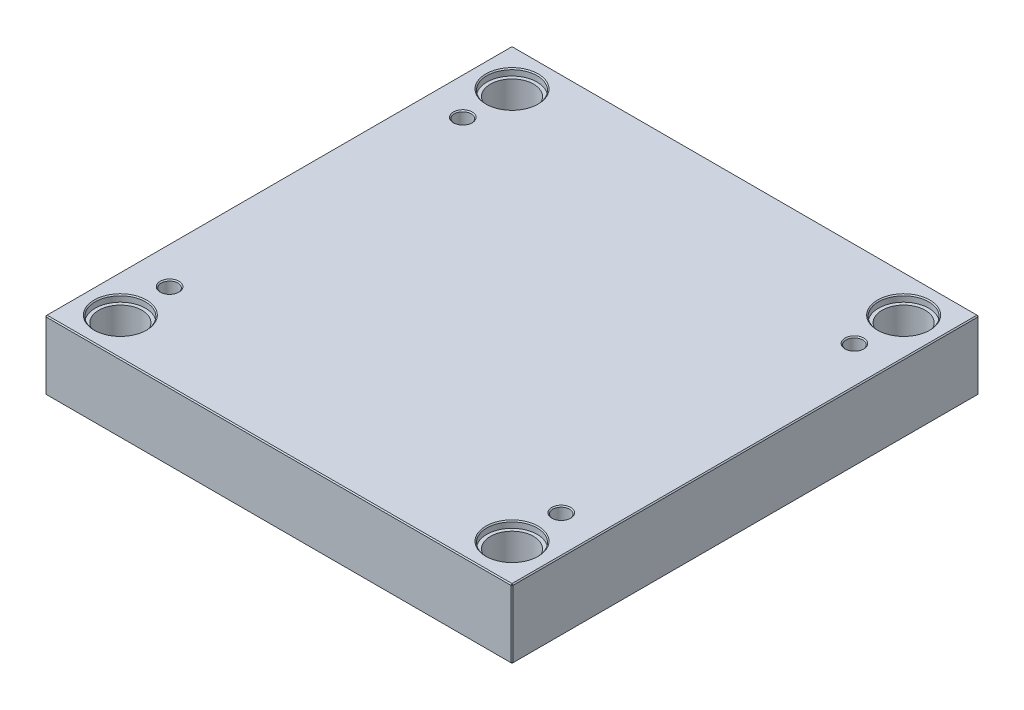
ISO-10303-21;
HEADER;
FILE_DESCRIPTION(('STEP AP214'),'2;1');
FILE_NAME('part.step','',(''),(''),'','','');
FILE_SCHEMA(('AUTOMOTIVE_DESIGN { 1 0 10303 214 1 1 1 1 }'));
ENDSEC;
DATA;
#1=APPLICATION_CONTEXT('core data for automotive mechanical design processes');
#2=APPLICATION_PROTOCOL_DEFINITION('international standard','automotive_design',2000,#1);
#3=PRODUCT_CONTEXT('',#1,'mechanical');
#4=PRODUCT('Part','Part','',(#3));
#5=PRODUCT_RELATED_PRODUCT_CATEGORY('part','',(#4));
#6=PRODUCT_DEFINITION_FORMATION('','',#4);
#7=PRODUCT_DEFINITION_CONTEXT('part definition',#1,'design');
#8=PRODUCT_DEFINITION('design','',#6,#7);
#9=PRODUCT_DEFINITION_SHAPE('','',#8);
#10=(LENGTH_UNIT() NAMED_UNIT(*) SI_UNIT(.MILLI.,.METRE.));
#11=(NAMED_UNIT(*) PLANE_ANGLE_UNIT() SI_UNIT($,.RADIAN.));
#12=(NAMED_UNIT(*) SI_UNIT($,.STERADIAN.) SOLID_ANGLE_UNIT());
#13=UNCERTAINTY_MEASURE_WITH_UNIT(LENGTH_MEASURE(1.E-05),#10,'distance_accuracy_value','');
#14=(GEOMETRIC_REPRESENTATION_CONTEXT(3) GLOBAL_UNCERTAINTY_ASSIGNED_CONTEXT((#13)) GLOBAL_UNIT_ASSIGNED_CONTEXT((#10,
#11,#12)) REPRESENTATION_CONTEXT('',''));
#15=CARTESIAN_POINT('',(0.,0.,0.));
#16=DIRECTION('',(0.,0.,1.));
#17=DIRECTION('',(1.,0.,0.));
#18=AXIS2_PLACEMENT_3D('',#15,#16,#17);
#19=CARTESIAN_POINT('',(-187.,0.,-187.));
#20=DIRECTION('',(0.,1.,0.));
#21=DIRECTION('',(0.,0.,1.));
#22=AXIS2_PLACEMENT_3D('',#19,#20,#21);
#23=CYLINDRICAL_SURFACE('',#22,20.65);
#24=CARTESIAN_POINT('',(-187.,0.999999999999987,-187.));
#25=DIRECTION('',(0.,1.,0.));
#26=DIRECTION('',(0.,0.,1.));
#27=AXIS2_PLACEMENT_3D('',#24,#25,#26);
#28=CIRCLE('',#27,20.65);
#29=CARTESIAN_POINT('',(-187.,0.999999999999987,-166.35));
#30=VERTEX_POINT('',#29);
#31=EDGE_CURVE('E472',#30,#30,#28,.F.);
#32=ORIENTED_EDGE('',*,*,#31,.T.);
#33=EDGE_LOOP('',(#32));
#34=FACE_BOUND('',#33,.T.);
#35=CARTESIAN_POINT('',(-187.,59.7,-187.));
#36=DIRECTION('',(0.,1.,0.));
#37=DIRECTION('',(0.,0.,1.));
#38=AXIS2_PLACEMENT_3D('',#35,#36,#37);
#39=CIRCLE('',#38,20.65);
#40=CARTESIAN_POINT('',(-187.,59.7,-166.35));
#41=VERTEX_POINT('',#40);
#42=EDGE_CURVE('E221',#41,#41,#39,.F.);
#43=ORIENTED_EDGE('',*,*,#42,.F.);
#44=EDGE_LOOP('',(#43));
#45=FACE_BOUND('',#44,.T.);
#46=ADVANCED_FACE('F16',(#34,#45),#23,.F.);
#47=CARTESIAN_POINT('',(187.,0.,-187.));
#48=DIRECTION('',(0.,1.,0.));
#49=DIRECTION('',(0.,0.,1.));
#50=AXIS2_PLACEMENT_3D('',#47,#48,#49);
#51=CYLINDRICAL_SURFACE('',#50,20.65);
#52=CARTESIAN_POINT('',(187.,0.999999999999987,-187.));
#53=DIRECTION('',(0.,1.,0.));
#54=DIRECTION('',(0.,0.,1.));
#55=AXIS2_PLACEMENT_3D('',#52,#53,#54);
#56=CIRCLE('',#55,20.65);
#57=CARTESIAN_POINT('',(187.,0.999999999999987,-166.35));
#58=VERTEX_POINT('',#57);
#59=EDGE_CURVE('E474',#58,#58,#56,.F.);
#60=ORIENTED_EDGE('',*,*,#59,.T.);
#61=EDGE_LOOP('',(#60));
#62=FACE_BOUND('',#61,.T.);
#63=CARTESIAN_POINT('',(187.,59.7,-187.));
#64=DIRECTION('',(0.,1.,0.));
#65=DIRECTION('',(0.,0.,1.));
#66=AXIS2_PLACEMENT_3D('',#63,#64,#65);
#67=CIRCLE('',#66,20.65);
#68=CARTESIAN_POINT('',(187.,59.7,-166.35));
#69=VERTEX_POINT('',#68);
#70=EDGE_CURVE('E218',#69,#69,#67,.F.);
#71=ORIENTED_EDGE('',*,*,#70,.F.);
#72=EDGE_LOOP('',(#71));
#73=FACE_BOUND('',#72,.T.);
#74=ADVANCED_FACE('F263',(#62,#73),#51,.F.);
#75=CARTESIAN_POINT('',(187.,0.,187.));
#76=DIRECTION('',(0.,1.,0.));
#77=DIRECTION('',(0.,0.,1.));
#78=AXIS2_PLACEMENT_3D('',#75,#76,#77);
#79=CYLINDRICAL_SURFACE('',#78,20.65);
#80=CARTESIAN_POINT('',(187.,0.99999999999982,187.));
#81=DIRECTION('',(0.,1.,0.));
#82=DIRECTION('',(0.,0.,1.));
#83=AXIS2_PLACEMENT_3D('',#80,#81,#82);
#84=CIRCLE('',#83,20.65);
#85=CARTESIAN_POINT('',(187.,0.99999999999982,207.65));
#86=VERTEX_POINT('',#85);
#87=EDGE_CURVE('E477',#86,#86,#84,.F.);
#88=ORIENTED_EDGE('',*,*,#87,.T.);
#89=EDGE_LOOP('',(#88));
#90=FACE_BOUND('',#89,.T.);
#91=CARTESIAN_POINT('',(187.,59.7,187.));
#92=DIRECTION('',(0.,1.,0.));
#93=DIRECTION('',(0.,0.,1.));
#94=AXIS2_PLACEMENT_3D('',#91,#92,#93);
#95=CIRCLE('',#94,20.65);
#96=CARTESIAN_POINT('',(187.,59.7,207.65));
#97=VERTEX_POINT('',#96);
#98=EDGE_CURVE('E214',#97,#97,#95,.F.);
#99=ORIENTED_EDGE('',*,*,#98,.F.);
#100=EDGE_LOOP('',(#99));
#101=FACE_BOUND('',#100,.T.);
#102=ADVANCED_FACE('F270',(#90,#101),#79,.F.);
#103=CARTESIAN_POINT('',(-187.,0.,187.));
#104=DIRECTION('',(0.,1.,0.));
#105=DIRECTION('',(0.,0.,1.));
#106=AXIS2_PLACEMENT_3D('',#103,#104,#105);
#107=CYLINDRICAL_SURFACE('',#106,20.65);
#108=CARTESIAN_POINT('',(-187.,0.99999999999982,187.));
#109=DIRECTION('',(0.,1.,0.));
#110=DIRECTION('',(0.,0.,1.));
#111=AXIS2_PLACEMENT_3D('',#108,#109,#110);
#112=CIRCLE('',#111,20.65);
#113=CARTESIAN_POINT('',(-187.,0.99999999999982,207.65));
#114=VERTEX_POINT('',#113);
#115=EDGE_CURVE('E480',#114,#114,#112,.F.);
#116=ORIENTED_EDGE('',*,*,#115,.T.);
#117=EDGE_LOOP('',(#116));
#118=FACE_BOUND('',#117,.T.);
#119=CARTESIAN_POINT('',(-187.,59.7,187.));
#120=DIRECTION('',(0.,1.,0.));
#121=DIRECTION('',(0.,0.,1.));
#122=AXIS2_PLACEMENT_3D('',#119,#120,#121);
#123=CIRCLE('',#122,20.65);
#124=CARTESIAN_POINT('',(-187.,59.7,207.65));
#125=VERTEX_POINT('',#124);
#126=EDGE_CURVE('E211',#125,#125,#123,.F.);
#127=ORIENTED_EDGE('',*,*,#126,.F.);
#128=EDGE_LOOP('',(#127));
#129=FACE_BOUND('',#128,.T.);
#130=ADVANCED_FACE('F277',(#118,#129),#107,.F.);
#131=CARTESIAN_POINT('',(-223.,66.,223.));
#132=DIRECTION('',(1.,0.,0.));
#133=DIRECTION('',(0.,0.,-1.));
#134=AXIS2_PLACEMENT_3D('',#131,#132,#133);
#135=PLANE('',#134);
#136=DIRECTION('',(0.,-1.,0.));
#137=VECTOR('',#136,1.);
#138=CARTESIAN_POINT('',(-223.,66.,-222.));
#139=LINE('',#138,#137);
#140=CARTESIAN_POINT('',(-223.,65.,-222.));
#141=VERTEX_POINT('',#140);
#142=CARTESIAN_POINT('',(-223.,1.,-222.));
#143=VERTEX_POINT('',#142);
#144=EDGE_CURVE('E487',#141,#143,#139,.T.);
#145=ORIENTED_EDGE('',*,*,#144,.T.);
#146=DIRECTION('',(0.,0.,1.));
#147=VECTOR('',#146,1.);
#148=CARTESIAN_POINT('',(-223.,1.,223.));
#149=LINE('',#148,#147);
#150=CARTESIAN_POINT('',(-223.,1.,222.));
#151=VERTEX_POINT('',#150);
#152=EDGE_CURVE('E490',#143,#151,#149,.T.);
#153=ORIENTED_EDGE('',*,*,#152,.T.);
#154=DIRECTION('',(0.,1.,0.));
#155=VECTOR('',#154,1.);
#156=CARTESIAN_POINT('',(-223.,66.,222.));
#157=LINE('',#156,#155);
#158=CARTESIAN_POINT('',(-223.,65.,222.));
#159=VERTEX_POINT('',#158);
#160=EDGE_CURVE('E485',#151,#159,#157,.T.);
#161=ORIENTED_EDGE('',*,*,#160,.T.);
#162=DIRECTION('',(0.,0.,-1.));
#163=VECTOR('',#162,1.);
#164=CARTESIAN_POINT('',(-223.,65.,-223.));
#165=LINE('',#164,#163);
#166=EDGE_CURVE('E483',#159,#141,#165,.T.);
#167=ORIENTED_EDGE('',*,*,#166,.T.);
#168=EDGE_LOOP('',(#145,#153,#161,#167));
#169=FACE_BOUND('',#168,.T.);
#170=ADVANCED_FACE('F298',(#169),#135,.F.);
#171=CARTESIAN_POINT('',(223.,66.,223.));
#172=DIRECTION('',(0.,0.,-1.));
#173=DIRECTION('',(-1.,0.,0.));
#174=AXIS2_PLACEMENT_3D('',#171,#172,#173);
#175=PLANE('',#174);
#176=DIRECTION('',(-1.,0.,0.));
#177=VECTOR('',#176,1.);
#178=CARTESIAN_POINT('',(-223.,65.,223.));
#179=LINE('',#178,#177);
#180=CARTESIAN_POINT('',(222.,65.,223.));
#181=VERTEX_POINT('',#180);
#182=CARTESIAN_POINT('',(-222.,65.,223.));
#183=VERTEX_POINT('',#182);
#184=EDGE_CURVE('E509',#181,#183,#179,.T.);
#185=ORIENTED_EDGE('',*,*,#184,.T.);
#186=DIRECTION('',(0.,-1.,0.));
#187=VECTOR('',#186,1.);
#188=CARTESIAN_POINT('',(-222.,66.,223.));
#189=LINE('',#188,#187);
#190=CARTESIAN_POINT('',(-222.,1.,223.));
#191=VERTEX_POINT('',#190);
#192=EDGE_CURVE('E515',#183,#191,#189,.T.);
#193=ORIENTED_EDGE('',*,*,#192,.T.);
#194=DIRECTION('',(1.,0.,0.));
#195=VECTOR('',#194,1.);
#196=CARTESIAN_POINT('',(223.,1.,223.));
#197=LINE('',#196,#195);
#198=CARTESIAN_POINT('',(222.,1.,223.));
#199=VERTEX_POINT('',#198);
#200=EDGE_CURVE('E513',#191,#199,#197,.T.);
#201=ORIENTED_EDGE('',*,*,#200,.T.);
#202=DIRECTION('',(0.,1.,0.));
#203=VECTOR('',#202,1.);
#204=CARTESIAN_POINT('',(222.,66.,223.));
#205=LINE('',#204,#203);
#206=EDGE_CURVE('E511',#199,#181,#205,.T.);
#207=ORIENTED_EDGE('',*,*,#206,.T.);
#208=EDGE_LOOP('',(#185,#193,#201,#207));
#209=FACE_BOUND('',#208,.T.);
#210=ADVANCED_FACE('F294',(#209),#175,.F.);
#211=CARTESIAN_POINT('',(223.,66.,223.));
#212=DIRECTION('',(-1.,0.,0.));
#213=DIRECTION('',(0.,0.,1.));
#214=AXIS2_PLACEMENT_3D('',#211,#212,#213);
#215=PLANE('',#214);
#216=DIRECTION('',(0.,0.,-1.));
#217=VECTOR('',#216,1.);
#218=CARTESIAN_POINT('',(223.,1.,223.));
#219=LINE('',#218,#217);
#220=CARTESIAN_POINT('',(223.,1.,222.));
#221=VERTEX_POINT('',#220);
#222=CARTESIAN_POINT('',(223.,1.,-222.));
#223=VERTEX_POINT('',#222);
#224=EDGE_CURVE('E504',#221,#223,#219,.T.);
#225=ORIENTED_EDGE('',*,*,#224,.T.);
#226=DIRECTION('',(0.,1.,0.));
#227=VECTOR('',#226,1.);
#228=CARTESIAN_POINT('',(223.,66.,-222.));
#229=LINE('',#228,#227);
#230=CARTESIAN_POINT('',(223.,65.,-222.));
#231=VERTEX_POINT('',#230);
#232=EDGE_CURVE('E506',#223,#231,#229,.T.);
#233=ORIENTED_EDGE('',*,*,#232,.T.);
#234=DIRECTION('',(0.,0.,1.));
#235=VECTOR('',#234,1.);
#236=CARTESIAN_POINT('',(223.,65.,223.));
#237=LINE('',#236,#235);
#238=CARTESIAN_POINT('',(223.,65.,222.));
#239=VERTEX_POINT('',#238);
#240=EDGE_CURVE('E500',#231,#239,#237,.T.);
#241=ORIENTED_EDGE('',*,*,#240,.T.);
#242=DIRECTION('',(0.,-1.,0.));
#243=VECTOR('',#242,1.);
#244=CARTESIAN_POINT('',(223.,66.,222.));
#245=LINE('',#244,#243);
#246=EDGE_CURVE('E502',#239,#221,#245,.T.);
#247=ORIENTED_EDGE('',*,*,#246,.T.);
#248=EDGE_LOOP('',(#225,#233,#241,#247));
#249=FACE_BOUND('',#248,.T.);
#250=ADVANCED_FACE('F290',(#249),#215,.F.);
#251=CARTESIAN_POINT('',(223.,66.,-223.));
#252=DIRECTION('',(0.,0.,1.));
#253=DIRECTION('',(1.,0.,0.));
#254=AXIS2_PLACEMENT_3D('',#251,#252,#253);
#255=PLANE('',#254);
#256=DIRECTION('',(0.,-1.,0.));
#257=VECTOR('',#256,1.);
#258=CARTESIAN_POINT('',(222.,66.,-223.));
#259=LINE('',#258,#257);
#260=CARTESIAN_POINT('',(222.,65.,-223.));
#261=VERTEX_POINT('',#260);
#262=CARTESIAN_POINT('',(222.,1.,-223.));
#263=VERTEX_POINT('',#262);
#264=EDGE_CURVE('E494',#261,#263,#259,.T.);
#265=ORIENTED_EDGE('',*,*,#264,.T.);
#266=DIRECTION('',(-1.,0.,0.));
#267=VECTOR('',#266,1.);
#268=CARTESIAN_POINT('',(223.,1.,-223.));
#269=LINE('',#268,#267);
#270=CARTESIAN_POINT('',(-222.,1.,-223.));
#271=VERTEX_POINT('',#270);
#272=EDGE_CURVE('E138',#263,#271,#269,.T.);
#273=ORIENTED_EDGE('',*,*,#272,.T.);
#274=DIRECTION('',(0.,1.,0.));
#275=VECTOR('',#274,1.);
#276=CARTESIAN_POINT('',(-222.,66.,-223.));
#277=LINE('',#276,#275);
#278=CARTESIAN_POINT('',(-222.,65.,-223.));
#279=VERTEX_POINT('',#278);
#280=EDGE_CURVE('E496',#271,#279,#277,.T.);
#281=ORIENTED_EDGE('',*,*,#280,.T.);
#282=DIRECTION('',(1.,0.,0.));
#283=VECTOR('',#282,1.);
#284=CARTESIAN_POINT('',(223.,65.,-223.));
#285=LINE('',#284,#283);
#286=EDGE_CURVE('E492',#279,#261,#285,.T.);
#287=ORIENTED_EDGE('',*,*,#286,.T.);
#288=EDGE_LOOP('',(#265,#273,#281,#287));
#289=FACE_BOUND('',#288,.T.);
#290=ADVANCED_FACE('F282',(#289),#255,.F.);
#291=CARTESIAN_POINT('',(0.,66.,0.));
#292=DIRECTION('',(0.,1.,0.));
#293=DIRECTION('',(0.,0.,1.));
#294=AXIS2_PLACEMENT_3D('',#291,#292,#293);
#295=PLANE('',#294);
#296=CARTESIAN_POINT('',(187.,66.,187.));
#297=DIRECTION('',(0.,1.,0.));
#298=DIRECTION('',(0.,0.,1.));
#299=AXIS2_PLACEMENT_3D('',#296,#297,#298);
#300=CIRCLE('',#299,25.);
#301=CARTESIAN_POINT('',(187.,66.,212.));
#302=VERTEX_POINT('',#301);
#303=EDGE_CURVE('E236',#302,#302,#300,.F.);
#304=ORIENTED_EDGE('',*,*,#303,.T.);
#305=EDGE_LOOP('',(#304));
#306=FACE_BOUND('',#305,.T.);
#307=CARTESIAN_POINT('',(-187.,66.,187.));
#308=DIRECTION('',(0.,1.,0.));
#309=DIRECTION('',(0.,0.,1.));
#310=AXIS2_PLACEMENT_3D('',#307,#308,#309);
#311=CIRCLE('',#310,25.);
#312=CARTESIAN_POINT('',(-187.,66.,212.));
#313=VERTEX_POINT('',#312);
#314=EDGE_CURVE('E233',#313,#313,#311,.F.);
#315=ORIENTED_EDGE('',*,*,#314,.T.);
#316=EDGE_LOOP('',(#315));
#317=FACE_BOUND('',#316,.T.);
#318=CARTESIAN_POINT('',(187.,66.,-187.));
#319=DIRECTION('',(0.,1.,0.));
#320=DIRECTION('',(0.,0.,1.));
#321=AXIS2_PLACEMENT_3D('',#318,#319,#320);
#322=CIRCLE('',#321,25.);
#323=CARTESIAN_POINT('',(187.,66.,-162.));
#324=VERTEX_POINT('',#323);
#325=EDGE_CURVE('E230',#324,#324,#322,.F.);
#326=ORIENTED_EDGE('',*,*,#325,.T.);
#327=EDGE_LOOP('',(#326));
#328=FACE_BOUND('',#327,.T.);
#329=CARTESIAN_POINT('',(-187.,66.,-187.));
#330=DIRECTION('',(0.,1.,0.));
#331=DIRECTION('',(0.,0.,1.));
#332=AXIS2_PLACEMENT_3D('',#329,#330,#331);
#333=CIRCLE('',#332,25.);
#334=CARTESIAN_POINT('',(-187.,66.,-162.));
#335=VERTEX_POINT('',#334);
#336=EDGE_CURVE('E227',#335,#335,#333,.F.);
#337=ORIENTED_EDGE('',*,*,#336,.T.);
#338=EDGE_LOOP('',(#337));
#339=FACE_BOUND('',#338,.T.);
#340=CARTESIAN_POINT('',(-187.,66.,140.));
#341=DIRECTION('',(0.,1.,0.));
#342=DIRECTION('',(0.,0.,1.));
#343=AXIS2_PLACEMENT_3D('',#340,#341,#342);
#344=CIRCLE('',#343,8.9999999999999);
#345=CARTESIAN_POINT('',(-187.,66.,149.));
#346=VERTEX_POINT('',#345);
#347=EDGE_CURVE('E198',#346,#346,#344,.F.);
#348=ORIENTED_EDGE('',*,*,#347,.T.);
#349=EDGE_LOOP('',(#348));
#350=FACE_BOUND('',#349,.T.);
#351=CARTESIAN_POINT('',(187.,66.,140.));
#352=DIRECTION('',(0.,1.,0.));
#353=DIRECTION('',(0.,0.,1.));
#354=AXIS2_PLACEMENT_3D('',#351,#352,#353);
#355=CIRCLE('',#354,8.9999999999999);
#356=CARTESIAN_POINT('',(187.,66.,149.));
#357=VERTEX_POINT('',#356);
#358=EDGE_CURVE('E195',#357,#357,#355,.F.);
#359=ORIENTED_EDGE('',*,*,#358,.T.);
#360=EDGE_LOOP('',(#359));
#361=FACE_BOUND('',#360,.T.);
#362=CARTESIAN_POINT('',(187.,66.,-140.));
#363=DIRECTION('',(0.,1.,0.));
#364=DIRECTION('',(0.,0.,1.));
#365=AXIS2_PLACEMENT_3D('',#362,#363,#364);
#366=CIRCLE('',#365,8.9999999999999);
#367=CARTESIAN_POINT('',(187.,66.,-131.));
#368=VERTEX_POINT('',#367);
#369=EDGE_CURVE('E192',#368,#368,#366,.F.);
#370=ORIENTED_EDGE('',*,*,#369,.T.);
#371=EDGE_LOOP('',(#370));
#372=FACE_BOUND('',#371,.T.);
#373=CARTESIAN_POINT('',(-187.,66.,-140.));
#374=DIRECTION('',(0.,1.,0.));
#375=DIRECTION('',(0.,0.,1.));
#376=AXIS2_PLACEMENT_3D('',#373,#374,#375);
#377=CIRCLE('',#376,8.9999999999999);
#378=CARTESIAN_POINT('',(-187.,66.,-131.));
#379=VERTEX_POINT('',#378);
#380=EDGE_CURVE('E188',#379,#379,#377,.F.);
#381=ORIENTED_EDGE('',*,*,#380,.T.);
#382=EDGE_LOOP('',(#381));
#383=FACE_BOUND('',#382,.T.);
#384=DIRECTION('',(0.,0.,-1.));
#385=VECTOR('',#384,1.);
#386=CARTESIAN_POINT('',(222.,66.,-223.));
#387=LINE('',#386,#385);
#388=CARTESIAN_POINT('',(222.,66.,222.));
#389=VERTEX_POINT('',#388);
#390=CARTESIAN_POINT('',(222.,66.,-222.));
#391=VERTEX_POINT('',#390);
#392=EDGE_CURVE('E31',#389,#391,#387,.T.);
#393=ORIENTED_EDGE('',*,*,#392,.T.);
#394=DIRECTION('',(-1.,0.,0.));
#395=VECTOR('',#394,1.);
#396=CARTESIAN_POINT('',(-223.,66.,-222.));
#397=LINE('',#396,#395);
#398=CARTESIAN_POINT('',(-222.,66.,-222.));
#399=VERTEX_POINT('',#398);
#400=EDGE_CURVE('E189',#391,#399,#397,.T.);
#401=ORIENTED_EDGE('',*,*,#400,.T.);
#402=DIRECTION('',(0.,0.,1.));
#403=VECTOR('',#402,1.);
#404=CARTESIAN_POINT('',(-222.,66.,223.));
#405=LINE('',#404,#403);
#406=CARTESIAN_POINT('',(-222.,66.,222.));
#407=VERTEX_POINT('',#406);
#408=EDGE_CURVE('E518',#399,#407,#405,.T.);
#409=ORIENTED_EDGE('',*,*,#408,.T.);
#410=DIRECTION('',(1.,0.,0.));
#411=VECTOR('',#410,1.);
#412=CARTESIAN_POINT('',(223.,66.,222.));
#413=LINE('',#412,#411);
#414=EDGE_CURVE('E36',#407,#389,#413,.T.);
#415=ORIENTED_EDGE('',*,*,#414,.T.);
#416=EDGE_LOOP('',(#393,#401,#409,#415));
#417=FACE_BOUND('',#416,.T.);
#418=ADVANCED_FACE('F279',(#306,#317,#328,#339,#350,#361,#372,#383,#417),#295,.T.);
#419=CARTESIAN_POINT('',(0.,0.,0.));
#420=DIRECTION('',(0.,1.,0.));
#421=DIRECTION('',(0.,0.,1.));
#422=AXIS2_PLACEMENT_3D('',#419,#420,#421);
#423=PLANE('',#422);
#424=CARTESIAN_POINT('',(-187.,0.,-187.));
#425=DIRECTION('',(0.,1.,0.));
#426=DIRECTION('',(0.,0.,1.));
#427=AXIS2_PLACEMENT_3D('',#424,#425,#426);
#428=CIRCLE('',#427,21.65);
#429=CARTESIAN_POINT('',(-187.,0.,-165.35));
#430=VERTEX_POINT('',#429);
#431=EDGE_CURVE('E469',#430,#430,#428,.T.);
#432=ORIENTED_EDGE('',*,*,#431,.T.);
#433=EDGE_LOOP('',(#432));
#434=FACE_BOUND('',#433,.T.);
#435=CARTESIAN_POINT('',(187.,0.,-187.));
#436=DIRECTION('',(0.,1.,0.));
#437=DIRECTION('',(0.,0.,1.));
#438=AXIS2_PLACEMENT_3D('',#435,#436,#437);
#439=CIRCLE('',#438,21.65);
#440=CARTESIAN_POINT('',(187.,0.,-165.35));
#441=VERTEX_POINT('',#440);
#442=EDGE_CURVE('E466',#441,#441,#439,.T.);
#443=ORIENTED_EDGE('',*,*,#442,.T.);
#444=EDGE_LOOP('',(#443));
#445=FACE_BOUND('',#444,.T.);
#446=CARTESIAN_POINT('',(187.,0.,187.));
#447=DIRECTION('',(0.,1.,0.));
#448=DIRECTION('',(0.,0.,1.));
#449=AXIS2_PLACEMENT_3D('',#446,#447,#448);
#450=CIRCLE('',#449,21.65);
#451=CARTESIAN_POINT('',(187.,0.,208.65));
#452=VERTEX_POINT('',#451);
#453=EDGE_CURVE('E463',#452,#452,#450,.T.);
#454=ORIENTED_EDGE('',*,*,#453,.T.);
#455=EDGE_LOOP('',(#454));
#456=FACE_BOUND('',#455,.T.);
#457=CARTESIAN_POINT('',(-187.,0.,187.));
#458=DIRECTION('',(0.,1.,0.));
#459=DIRECTION('',(0.,0.,1.));
#460=AXIS2_PLACEMENT_3D('',#457,#458,#459);
#461=CIRCLE('',#460,21.65);
#462=CARTESIAN_POINT('',(-187.,0.,208.65));
#463=VERTEX_POINT('',#462);
#464=EDGE_CURVE('E460',#463,#463,#461,.T.);
#465=ORIENTED_EDGE('',*,*,#464,.T.);
#466=EDGE_LOOP('',(#465));
#467=FACE_BOUND('',#466,.T.);
#468=DIRECTION('',(0.,0.,1.));
#469=VECTOR('',#468,1.);
#470=CARTESIAN_POINT('',(222.,0.,0.));
#471=LINE('',#470,#469);
#472=CARTESIAN_POINT('',(222.,0.,-222.));
#473=VERTEX_POINT('',#472);
#474=CARTESIAN_POINT('',(222.,0.,222.));
#475=VERTEX_POINT('',#474);
#476=EDGE_CURVE('E108',#473,#475,#471,.T.);
#477=ORIENTED_EDGE('',*,*,#476,.T.);
#478=DIRECTION('',(-1.,0.,0.));
#479=VECTOR('',#478,1.);
#480=CARTESIAN_POINT('',(0.,0.,222.));
#481=LINE('',#480,#479);
#482=CARTESIAN_POINT('',(-222.,0.,222.));
#483=VERTEX_POINT('',#482);
#484=EDGE_CURVE('E458',#475,#483,#481,.T.);
#485=ORIENTED_EDGE('',*,*,#484,.T.);
#486=DIRECTION('',(0.,0.,-1.));
#487=VECTOR('',#486,1.);
#488=CARTESIAN_POINT('',(-222.,0.,0.));
#489=LINE('',#488,#487);
#490=CARTESIAN_POINT('',(-222.,0.,-222.));
#491=VERTEX_POINT('',#490);
#492=EDGE_CURVE('E110',#483,#491,#489,.T.);
#493=ORIENTED_EDGE('',*,*,#492,.T.);
#494=DIRECTION('',(1.,0.,0.));
#495=VECTOR('',#494,1.);
#496=CARTESIAN_POINT('',(0.,0.,-222.));
#497=LINE('',#496,#495);
#498=EDGE_CURVE('E104',#491,#473,#497,.T.);
#499=ORIENTED_EDGE('',*,*,#498,.T.);
#500=EDGE_LOOP('',(#477,#485,#493,#499));
#501=FACE_BOUND('',#500,.T.);
#502=ADVANCED_FACE('F106',(#434,#445,#456,#467,#501),#423,.F.);
#503=CARTESIAN_POINT('',(-187.,0.,-187.));
#504=DIRECTION('',(0.,-1.,0.));
#505=DIRECTION('',(0.,0.,-1.));
#506=AXIS2_PLACEMENT_3D('',#503,#504,#505);
#507=CONICAL_SURFACE('',#506,21.65,0.785398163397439);
#508=ORIENTED_EDGE('',*,*,#31,.F.);
#509=EDGE_LOOP('',(#508));
#510=FACE_BOUND('',#509,.T.);
#511=ORIENTED_EDGE('',*,*,#431,.F.);
#512=EDGE_LOOP('',(#511));
#513=FACE_BOUND('',#512,.T.);
#514=ADVANCED_FACE('F286',(#510,#513),#507,.F.);
#515=CARTESIAN_POINT('',(187.,0.,-187.));
#516=DIRECTION('',(0.,-1.,0.));
#517=DIRECTION('',(0.,0.,-1.));
#518=AXIS2_PLACEMENT_3D('',#515,#516,#517);
#519=CONICAL_SURFACE('',#518,21.65,0.785398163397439);
#520=ORIENTED_EDGE('',*,*,#59,.F.);
#521=EDGE_LOOP('',(#520));
#522=FACE_BOUND('',#521,.T.);
#523=ORIENTED_EDGE('',*,*,#442,.F.);
#524=EDGE_LOOP('',(#523));
#525=FACE_BOUND('',#524,.T.);
#526=ADVANCED_FACE('F305',(#522,#525),#519,.F.);
#527=CARTESIAN_POINT('',(187.,0.,187.));
#528=DIRECTION('',(0.,-1.,0.));
#529=DIRECTION('',(0.,0.,-1.));
#530=AXIS2_PLACEMENT_3D('',#527,#528,#529);
#531=CONICAL_SURFACE('',#530,21.65,0.785398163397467);
#532=ORIENTED_EDGE('',*,*,#87,.F.);
#533=EDGE_LOOP('',(#532));
#534=FACE_BOUND('',#533,.T.);
#535=ORIENTED_EDGE('',*,*,#453,.F.);
#536=EDGE_LOOP('',(#535));
#537=FACE_BOUND('',#536,.T.);
#538=ADVANCED_FACE('F309',(#534,#537),#531,.F.);
#539=CARTESIAN_POINT('',(-187.,0.,187.));
#540=DIRECTION('',(0.,-1.,0.));
#541=DIRECTION('',(0.,0.,-1.));
#542=AXIS2_PLACEMENT_3D('',#539,#540,#541);
#543=CONICAL_SURFACE('',#542,21.65,0.785398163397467);
#544=ORIENTED_EDGE('',*,*,#115,.F.);
#545=EDGE_LOOP('',(#544));
#546=FACE_BOUND('',#545,.T.);
#547=ORIENTED_EDGE('',*,*,#464,.F.);
#548=EDGE_LOOP('',(#547));
#549=FACE_BOUND('',#548,.T.);
#550=ADVANCED_FACE('F313',(#546,#549),#543,.F.);
#551=CARTESIAN_POINT('',(223.,66.,222.));
#552=DIRECTION('',(-0.707106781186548,0.,-0.707106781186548));
#553=DIRECTION('',(0.,-1.,0.));
#554=AXIS2_PLACEMENT_3D('',#551,#552,#553);
#555=PLANE('',#554);
#556=DIRECTION('',(-0.707106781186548,0.,0.707106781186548));
#557=VECTOR('',#556,1.);
#558=CARTESIAN_POINT('',(222.,65.,223.));
#559=LINE('',#558,#557);
#560=EDGE_CURVE('E126',#181,#239,#559,.F.);
#561=ORIENTED_EDGE('',*,*,#560,.F.);
#562=ORIENTED_EDGE('',*,*,#206,.F.);
#563=DIRECTION('',(0.707106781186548,0.,-0.707106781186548));
#564=VECTOR('',#563,1.);
#565=CARTESIAN_POINT('',(222.,1.,223.));
#566=LINE('',#565,#564);
#567=EDGE_CURVE('E180',#221,#199,#566,.F.);
#568=ORIENTED_EDGE('',*,*,#567,.F.);
#569=ORIENTED_EDGE('',*,*,#246,.F.);
#570=EDGE_LOOP('',(#561,#562,#568,#569));
#571=FACE_BOUND('',#570,.T.);
#572=ADVANCED_FACE('F317',(#571),#555,.F.);
#573=CARTESIAN_POINT('',(222.,65.,223.));
#574=DIRECTION('',(0.577350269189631,0.577350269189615,0.577350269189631));
#575=DIRECTION('',(0.707106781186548,0.,-0.707106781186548));
#576=AXIS2_PLACEMENT_3D('',#573,#574,#575);
#577=PLANE('',#576);
#578=DIRECTION('',(0.,-0.707106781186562,0.707106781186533));
#579=VECTOR('',#578,1.);
#580=CARTESIAN_POINT('',(222.,65.,223.));
#581=LINE('',#580,#579);
#582=EDGE_CURVE('E175',#181,#389,#581,.F.);
#583=ORIENTED_EDGE('',*,*,#582,.F.);
#584=ORIENTED_EDGE('',*,*,#560,.T.);
#585=DIRECTION('',(-0.707106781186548,0.707106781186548,0.));
#586=VECTOR('',#585,1.);
#587=CARTESIAN_POINT('',(222.5,65.5,222.));
#588=LINE('',#587,#586);
#589=EDGE_CURVE('E177',#389,#239,#588,.F.);
#590=ORIENTED_EDGE('',*,*,#589,.F.);
#591=EDGE_LOOP('',(#583,#584,#590));
#592=FACE_BOUND('',#591,.T.);
#593=ADVANCED_FACE('F385',(#592),#577,.T.);
#594=CARTESIAN_POINT('',(222.,1.,223.));
#595=DIRECTION('',(0.577350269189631,-0.577350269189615,0.577350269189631));
#596=DIRECTION('',(0.707106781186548,0.,-0.707106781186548));
#597=AXIS2_PLACEMENT_3D('',#594,#595,#596);
#598=PLANE('',#597);
#599=DIRECTION('',(-0.707106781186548,-0.707106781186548,0.));
#600=VECTOR('',#599,1.);
#601=CARTESIAN_POINT('',(222.5,0.499999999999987,222.));
#602=LINE('',#601,#600);
#603=EDGE_CURVE('E124',#221,#475,#602,.T.);
#604=ORIENTED_EDGE('',*,*,#603,.F.);
#605=ORIENTED_EDGE('',*,*,#567,.T.);
#606=DIRECTION('',(0.,0.707106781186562,0.707106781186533));
#607=VECTOR('',#606,1.);
#608=CARTESIAN_POINT('',(222.,1.,223.));
#609=LINE('',#608,#607);
#610=EDGE_CURVE('E172',#475,#199,#609,.T.);
#611=ORIENTED_EDGE('',*,*,#610,.F.);
#612=EDGE_LOOP('',(#604,#605,#611));
#613=FACE_BOUND('',#612,.T.);
#614=ADVANCED_FACE('F381',(#613),#598,.T.);
#615=CARTESIAN_POINT('',(222.,66.,0.));
#616=DIRECTION('',(0.707106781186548,0.707106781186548,0.));
#617=DIRECTION('',(0.,0.,1.));
#618=AXIS2_PLACEMENT_3D('',#615,#616,#617);
#619=PLANE('',#618);
#620=ORIENTED_EDGE('',*,*,#589,.T.);
#621=ORIENTED_EDGE('',*,*,#240,.F.);
#622=DIRECTION('',(0.707106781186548,-0.707106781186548,0.));
#623=VECTOR('',#622,1.);
#624=CARTESIAN_POINT('',(223.,65.,-222.));
#625=LINE('',#624,#623);
#626=EDGE_CURVE('E166',#391,#231,#625,.T.);
#627=ORIENTED_EDGE('',*,*,#626,.F.);
#628=ORIENTED_EDGE('',*,*,#392,.F.);
#629=EDGE_LOOP('',(#620,#621,#627,#628));
#630=FACE_BOUND('',#629,.T.);
#631=ADVANCED_FACE('F377',(#630),#619,.T.);
#632=CARTESIAN_POINT('',(0.,66.,222.));
#633=DIRECTION('',(0.,0.707106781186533,0.707106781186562));
#634=DIRECTION('',(-1.,0.,0.));
#635=AXIS2_PLACEMENT_3D('',#632,#633,#634);
#636=PLANE('',#635);
#637=ORIENTED_EDGE('',*,*,#582,.T.);
#638=ORIENTED_EDGE('',*,*,#414,.F.);
#639=DIRECTION('',(0.,0.707106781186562,-0.707106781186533));
#640=VECTOR('',#639,1.);
#641=CARTESIAN_POINT('',(-222.,65.5,222.5));
#642=LINE('',#641,#640);
#643=EDGE_CURVE('E163',#183,#407,#642,.T.);
#644=ORIENTED_EDGE('',*,*,#643,.F.);
#645=ORIENTED_EDGE('',*,*,#184,.F.);
#646=EDGE_LOOP('',(#637,#638,#644,#645));
#647=FACE_BOUND('',#646,.T.);
#648=ADVANCED_FACE('F373',(#647),#636,.T.);
#649=CARTESIAN_POINT('',(-222.,66.,223.));
#650=DIRECTION('',(0.707106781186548,0.,-0.707106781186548));
#651=DIRECTION('',(0.,-1.,0.));
#652=AXIS2_PLACEMENT_3D('',#649,#650,#651);
#653=PLANE('',#652);
#654=DIRECTION('',(0.707106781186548,0.,0.707106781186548));
#655=VECTOR('',#654,1.);
#656=CARTESIAN_POINT('',(-222.,1.,223.));
#657=LINE('',#656,#655);
#658=EDGE_CURVE('E157',#191,#151,#657,.F.);
#659=ORIENTED_EDGE('',*,*,#658,.F.);
#660=ORIENTED_EDGE('',*,*,#192,.F.);
#661=DIRECTION('',(-0.707106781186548,0.,-0.707106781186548));
#662=VECTOR('',#661,1.);
#663=CARTESIAN_POINT('',(-223.,65.,222.));
#664=LINE('',#663,#662);
#665=EDGE_CURVE('E160',#159,#183,#664,.F.);
#666=ORIENTED_EDGE('',*,*,#665,.F.);
#667=ORIENTED_EDGE('',*,*,#160,.F.);
#668=EDGE_LOOP('',(#659,#660,#666,#667));
#669=FACE_BOUND('',#668,.T.);
#670=ADVANCED_FACE('F369',(#669),#653,.F.);
#671=CARTESIAN_POINT('',(223.,1.,223.));
#672=DIRECTION('',(0.,0.707106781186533,-0.707106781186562));
#673=DIRECTION('',(1.,0.,0.));
#674=AXIS2_PLACEMENT_3D('',#671,#672,#673);
#675=PLANE('',#674);
#676=ORIENTED_EDGE('',*,*,#610,.T.);
#677=ORIENTED_EDGE('',*,*,#200,.F.);
#678=DIRECTION('',(0.,-0.707106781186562,-0.707106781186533));
#679=VECTOR('',#678,1.);
#680=CARTESIAN_POINT('',(-222.,1.,223.));
#681=LINE('',#680,#679);
#682=EDGE_CURVE('E135',#483,#191,#681,.F.);
#683=ORIENTED_EDGE('',*,*,#682,.F.);
#684=ORIENTED_EDGE('',*,*,#484,.F.);
#685=EDGE_LOOP('',(#676,#677,#683,#684));
#686=FACE_BOUND('',#685,.T.);
#687=ADVANCED_FACE('F366',(#686),#675,.F.);
#688=CARTESIAN_POINT('',(223.,1.,223.));
#689=DIRECTION('',(-0.707106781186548,0.707106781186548,0.));
#690=DIRECTION('',(0.,0.,-1.));
#691=AXIS2_PLACEMENT_3D('',#688,#689,#690);
#692=PLANE('',#691);
#693=ORIENTED_EDGE('',*,*,#603,.T.);
#694=ORIENTED_EDGE('',*,*,#476,.F.);
#695=DIRECTION('',(0.707106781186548,0.707106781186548,0.));
#696=VECTOR('',#695,1.);
#697=CARTESIAN_POINT('',(222.5,0.499999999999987,-222.));
#698=LINE('',#697,#696);
#699=EDGE_CURVE('E121',#223,#473,#698,.F.);
#700=ORIENTED_EDGE('',*,*,#699,.F.);
#701=ORIENTED_EDGE('',*,*,#224,.F.);
#702=EDGE_LOOP('',(#693,#694,#700,#701));
#703=FACE_BOUND('',#702,.T.);
#704=ADVANCED_FACE('F119',(#703),#692,.F.);
#705=CARTESIAN_POINT('',(222.,66.,-223.));
#706=DIRECTION('',(-0.707106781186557,0.,0.707106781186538));
#707=DIRECTION('',(0.,-1.,0.));
#708=AXIS2_PLACEMENT_3D('',#705,#706,#707);
#709=PLANE('',#708);
#710=DIRECTION('',(0.707106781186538,0.,0.707106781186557));
#711=VECTOR('',#710,1.);
#712=CARTESIAN_POINT('',(223.,65.,-222.));
#713=LINE('',#712,#711);
#714=EDGE_CURVE('E168',#231,#261,#713,.F.);
#715=ORIENTED_EDGE('',*,*,#714,.F.);
#716=ORIENTED_EDGE('',*,*,#232,.F.);
#717=DIRECTION('',(-0.707106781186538,0.,-0.707106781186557));
#718=VECTOR('',#717,1.);
#719=CARTESIAN_POINT('',(222.,1.,-223.));
#720=LINE('',#719,#718);
#721=EDGE_CURVE('E134',#263,#223,#720,.F.);
#722=ORIENTED_EDGE('',*,*,#721,.F.);
#723=ORIENTED_EDGE('',*,*,#264,.F.);
#724=EDGE_LOOP('',(#715,#716,#722,#723));
#725=FACE_BOUND('',#724,.T.);
#726=ADVANCED_FACE('F359',(#725),#709,.F.);
#727=CARTESIAN_POINT('',(223.,65.,-222.));
#728=DIRECTION('',(0.577350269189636,0.57735026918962,-0.57735026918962));
#729=DIRECTION('',(-0.707106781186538,0.,-0.707106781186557));
#730=AXIS2_PLACEMENT_3D('',#727,#728,#729);
#731=PLANE('',#730);
#732=ORIENTED_EDGE('',*,*,#626,.T.);
#733=ORIENTED_EDGE('',*,*,#714,.T.);
#734=DIRECTION('',(0.,0.707106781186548,0.707106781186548));
#735=VECTOR('',#734,1.);
#736=CARTESIAN_POINT('',(222.,65.5,-222.5));
#737=LINE('',#736,#735);
#738=EDGE_CURVE('E152',#391,#261,#737,.F.);
#739=ORIENTED_EDGE('',*,*,#738,.F.);
#740=EDGE_LOOP('',(#732,#733,#739));
#741=FACE_BOUND('',#740,.T.);
#742=ADVANCED_FACE('F355',(#741),#731,.T.);
#743=CARTESIAN_POINT('',(-223.,65.,222.));
#744=DIRECTION('',(-0.577350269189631,0.577350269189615,0.577350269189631));
#745=DIRECTION('',(0.707106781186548,0.,0.707106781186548));
#746=AXIS2_PLACEMENT_3D('',#743,#744,#745);
#747=PLANE('',#746);
#748=ORIENTED_EDGE('',*,*,#665,.T.);
#749=ORIENTED_EDGE('',*,*,#643,.T.);
#750=DIRECTION('',(-0.707106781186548,-0.707106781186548,0.));
#751=VECTOR('',#750,1.);
#752=CARTESIAN_POINT('',(-223.,65.,222.));
#753=LINE('',#752,#751);
#754=EDGE_CURVE('E143',#159,#407,#753,.F.);
#755=ORIENTED_EDGE('',*,*,#754,.F.);
#756=EDGE_LOOP('',(#748,#749,#755));
#757=FACE_BOUND('',#756,.T.);
#758=ADVANCED_FACE('F351',(#757),#747,.T.);
#759=CARTESIAN_POINT('',(-222.,1.,223.));
#760=DIRECTION('',(-0.577350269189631,-0.577350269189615,0.577350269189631));
#761=DIRECTION('',(0.707106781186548,0.,0.707106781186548));
#762=AXIS2_PLACEMENT_3D('',#759,#760,#761);
#763=PLANE('',#762);
#764=ORIENTED_EDGE('',*,*,#682,.T.);
#765=ORIENTED_EDGE('',*,*,#658,.T.);
#766=DIRECTION('',(-0.707106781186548,0.707106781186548,0.));
#767=VECTOR('',#766,1.);
#768=CARTESIAN_POINT('',(-222.5,0.499999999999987,222.));
#769=LINE('',#768,#767);
#770=EDGE_CURVE('E139',#483,#151,#769,.T.);
#771=ORIENTED_EDGE('',*,*,#770,.F.);
#772=EDGE_LOOP('',(#764,#765,#771));
#773=FACE_BOUND('',#772,.T.);
#774=ADVANCED_FACE('F348',(#773),#763,.T.);
#775=CARTESIAN_POINT('',(222.,1.,-223.));
#776=DIRECTION('',(0.577350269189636,-0.57735026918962,-0.57735026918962));
#777=DIRECTION('',(-0.707106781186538,0.,-0.707106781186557));
#778=AXIS2_PLACEMENT_3D('',#775,#776,#777);
#779=PLANE('',#778);
#780=ORIENTED_EDGE('',*,*,#721,.T.);
#781=ORIENTED_EDGE('',*,*,#699,.T.);
#782=DIRECTION('',(0.,-0.707106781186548,0.707106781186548));
#783=VECTOR('',#782,1.);
#784=CARTESIAN_POINT('',(222.,1.,-223.));
#785=LINE('',#784,#783);
#786=EDGE_CURVE('E131',#263,#473,#785,.T.);
#787=ORIENTED_EDGE('',*,*,#786,.F.);
#788=EDGE_LOOP('',(#780,#781,#787));
#789=FACE_BOUND('',#788,.T.);
#790=ADVANCED_FACE('F130',(#789),#779,.T.);
#791=CARTESIAN_POINT('',(0.,66.,-222.));
#792=DIRECTION('',(0.,0.707106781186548,-0.707106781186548));
#793=DIRECTION('',(1.,0.,0.));
#794=AXIS2_PLACEMENT_3D('',#791,#792,#793);
#795=PLANE('',#794);
#796=ORIENTED_EDGE('',*,*,#738,.T.);
#797=ORIENTED_EDGE('',*,*,#286,.F.);
#798=DIRECTION('',(0.,-0.707106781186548,-0.707106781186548));
#799=VECTOR('',#798,1.);
#800=CARTESIAN_POINT('',(-222.,65.,-223.));
#801=LINE('',#800,#799);
#802=EDGE_CURVE('E140',#399,#279,#801,.T.);
#803=ORIENTED_EDGE('',*,*,#802,.F.);
#804=ORIENTED_EDGE('',*,*,#400,.F.);
#805=EDGE_LOOP('',(#796,#797,#803,#804));
#806=FACE_BOUND('',#805,.T.);
#807=ADVANCED_FACE('F341',(#806),#795,.T.);
#808=CARTESIAN_POINT('',(-222.,66.,0.));
#809=DIRECTION('',(-0.707106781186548,0.707106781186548,0.));
#810=DIRECTION('',(0.,0.,-1.));
#811=AXIS2_PLACEMENT_3D('',#808,#809,#810);
#812=PLANE('',#811);
#813=ORIENTED_EDGE('',*,*,#754,.T.);
#814=ORIENTED_EDGE('',*,*,#408,.F.);
#815=DIRECTION('',(0.707106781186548,0.707106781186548,0.));
#816=VECTOR('',#815,1.);
#817=CARTESIAN_POINT('',(-222.5,65.5,-222.));
#818=LINE('',#817,#816);
#819=EDGE_CURVE('E146',#141,#399,#818,.T.);
#820=ORIENTED_EDGE('',*,*,#819,.F.);
#821=ORIENTED_EDGE('',*,*,#166,.F.);
#822=EDGE_LOOP('',(#813,#814,#820,#821));
#823=FACE_BOUND('',#822,.T.);
#824=ADVANCED_FACE('F337',(#823),#812,.T.);
#825=CARTESIAN_POINT('',(-223.,1.,223.));
#826=DIRECTION('',(0.707106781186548,0.707106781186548,0.));
#827=DIRECTION('',(0.,0.,1.));
#828=AXIS2_PLACEMENT_3D('',#825,#826,#827);
#829=PLANE('',#828);
#830=ORIENTED_EDGE('',*,*,#770,.T.);
#831=ORIENTED_EDGE('',*,*,#152,.F.);
#832=DIRECTION('',(0.707106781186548,-0.707106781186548,0.));
#833=VECTOR('',#832,1.);
#834=CARTESIAN_POINT('',(-223.,1.,-222.));
#835=LINE('',#834,#833);
#836=EDGE_CURVE('E529',#491,#143,#835,.F.);
#837=ORIENTED_EDGE('',*,*,#836,.F.);
#838=ORIENTED_EDGE('',*,*,#492,.F.);
#839=EDGE_LOOP('',(#830,#831,#837,#838));
#840=FACE_BOUND('',#839,.T.);
#841=ADVANCED_FACE('F334',(#840),#829,.F.);
#842=CARTESIAN_POINT('',(223.,1.,-223.));
#843=DIRECTION('',(0.,0.707106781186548,0.707106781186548));
#844=DIRECTION('',(-1.,0.,0.));
#845=AXIS2_PLACEMENT_3D('',#842,#843,#844);
#846=PLANE('',#845);
#847=ORIENTED_EDGE('',*,*,#786,.T.);
#848=ORIENTED_EDGE('',*,*,#498,.F.);
#849=DIRECTION('',(0.,0.707106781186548,-0.707106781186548));
#850=VECTOR('',#849,1.);
#851=CARTESIAN_POINT('',(-222.,0.5,-222.5));
#852=LINE('',#851,#850);
#853=EDGE_CURVE('E526',#271,#491,#852,.F.);
#854=ORIENTED_EDGE('',*,*,#853,.F.);
#855=ORIENTED_EDGE('',*,*,#272,.F.);
#856=EDGE_LOOP('',(#847,#848,#854,#855));
#857=FACE_BOUND('',#856,.T.);
#858=ADVANCED_FACE('F137',(#857),#846,.F.);
#859=CARTESIAN_POINT('',(-222.,65.,-223.));
#860=DIRECTION('',(-0.577350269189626,0.577350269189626,-0.577350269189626));
#861=DIRECTION('',(-0.707106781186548,0.,0.707106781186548));
#862=AXIS2_PLACEMENT_3D('',#859,#860,#861);
#863=PLANE('',#862);
#864=ORIENTED_EDGE('',*,*,#819,.T.);
#865=ORIENTED_EDGE('',*,*,#802,.T.);
#866=DIRECTION('',(0.707106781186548,0.,-0.707106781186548));
#867=VECTOR('',#866,1.);
#868=CARTESIAN_POINT('',(-222.,65.,-223.));
#869=LINE('',#868,#867);
#870=EDGE_CURVE('E524',#141,#279,#869,.T.);
#871=ORIENTED_EDGE('',*,*,#870,.F.);
#872=EDGE_LOOP('',(#864,#865,#871));
#873=FACE_BOUND('',#872,.T.);
#874=ADVANCED_FACE('F327',(#873),#863,.T.);
#875=CARTESIAN_POINT('',(-223.,1.,-222.));
#876=DIRECTION('',(-0.577350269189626,-0.577350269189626,-0.577350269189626));
#877=DIRECTION('',(-0.707106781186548,0.,0.707106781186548));
#878=AXIS2_PLACEMENT_3D('',#875,#876,#877);
#879=PLANE('',#878);
#880=ORIENTED_EDGE('',*,*,#853,.T.);
#881=ORIENTED_EDGE('',*,*,#836,.T.);
#882=DIRECTION('',(-0.707106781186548,0.,0.707106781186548));
#883=VECTOR('',#882,1.);
#884=CARTESIAN_POINT('',(-223.,1.,-222.));
#885=LINE('',#884,#883);
#886=EDGE_CURVE('E455',#271,#143,#885,.T.);
#887=ORIENTED_EDGE('',*,*,#886,.F.);
#888=EDGE_LOOP('',(#880,#881,#887));
#889=FACE_BOUND('',#888,.T.);
#890=ADVANCED_FACE('F323',(#889),#879,.T.);
#891=CARTESIAN_POINT('',(-223.,66.,-222.));
#892=DIRECTION('',(0.707106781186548,0.,0.707106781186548));
#893=DIRECTION('',(0.,-1.,0.));
#894=AXIS2_PLACEMENT_3D('',#891,#892,#893);
#895=PLANE('',#894);
#896=ORIENTED_EDGE('',*,*,#870,.T.);
#897=ORIENTED_EDGE('',*,*,#280,.F.);
#898=ORIENTED_EDGE('',*,*,#886,.T.);
#899=ORIENTED_EDGE('',*,*,#144,.F.);
#900=EDGE_LOOP('',(#896,#897,#898,#899));
#901=FACE_BOUND('',#900,.T.);
#902=ADVANCED_FACE('F319',(#901),#895,.F.);
#903=CARTESIAN_POINT('',(-187.,41.,-140.));
#904=DIRECTION('',(0.,1.,0.));
#905=DIRECTION('',(0.,0.,1.));
#906=AXIS2_PLACEMENT_3D('',#903,#904,#905);
#907=CYLINDRICAL_SURFACE('',#906,8.);
#908=CARTESIAN_POINT('',(-187.,65.,-140.));
#909=DIRECTION('',(0.,1.,0.));
#910=DIRECTION('',(0.,0.,1.));
#911=AXIS2_PLACEMENT_3D('',#908,#909,#910);
#912=CIRCLE('',#911,8.);
#913=CARTESIAN_POINT('',(-187.,65.,-132.));
#914=VERTEX_POINT('',#913);
#915=EDGE_CURVE('E207',#914,#914,#912,.T.);
#916=ORIENTED_EDGE('',*,*,#915,.T.);
#917=EDGE_LOOP('',(#916));
#918=FACE_BOUND('',#917,.T.);
#919=CARTESIAN_POINT('',(-187.,41.,-140.));
#920=DIRECTION('',(0.,1.,0.));
#921=DIRECTION('',(0.,0.,1.));
#922=AXIS2_PLACEMENT_3D('',#919,#920,#921);
#923=CIRCLE('',#922,8.);
#924=CARTESIAN_POINT('',(-187.,41.,-132.));
#925=VERTEX_POINT('',#924);
#926=EDGE_CURVE('E448',#925,#925,#923,.T.);
#927=ORIENTED_EDGE('',*,*,#926,.F.);
#928=EDGE_LOOP('',(#927));
#929=FACE_BOUND('',#928,.T.);
#930=ADVANCED_FACE('F322',(#918,#929),#907,.F.);
#931=CARTESIAN_POINT('',(-187.,41.,-140.));
#932=DIRECTION('',(0.,1.,0.));
#933=DIRECTION('',(0.,0.,1.));
#934=AXIS2_PLACEMENT_3D('',#931,#932,#933);
#935=PLANE('',#934);
#936=ORIENTED_EDGE('',*,*,#926,.T.);
#937=EDGE_LOOP('',(#936));
#938=FACE_BOUND('',#937,.T.);
#939=ADVANCED_FACE('F596',(#938),#935,.T.);
#940=CARTESIAN_POINT('',(187.,41.,-140.));
#941=DIRECTION('',(0.,1.,0.));
#942=DIRECTION('',(0.,0.,1.));
#943=AXIS2_PLACEMENT_3D('',#940,#941,#942);
#944=CYLINDRICAL_SURFACE('',#943,8.);
#945=CARTESIAN_POINT('',(187.,65.,-140.));
#946=DIRECTION('',(0.,1.,0.));
#947=DIRECTION('',(0.,0.,1.));
#948=AXIS2_PLACEMENT_3D('',#945,#946,#947);
#949=CIRCLE('',#948,8.);
#950=CARTESIAN_POINT('',(187.,65.,-132.));
#951=VERTEX_POINT('',#950);
#952=EDGE_CURVE('E204',#951,#951,#949,.T.);
#953=ORIENTED_EDGE('',*,*,#952,.T.);
#954=EDGE_LOOP('',(#953));
#955=FACE_BOUND('',#954,.T.);
#956=CARTESIAN_POINT('',(187.,41.,-140.));
#957=DIRECTION('',(0.,1.,0.));
#958=DIRECTION('',(0.,0.,1.));
#959=AXIS2_PLACEMENT_3D('',#956,#957,#958);
#960=CIRCLE('',#959,8.);
#961=CARTESIAN_POINT('',(187.,41.,-132.));
#962=VERTEX_POINT('',#961);
#963=EDGE_CURVE('E445',#962,#962,#960,.T.);
#964=ORIENTED_EDGE('',*,*,#963,.F.);
#965=EDGE_LOOP('',(#964));
#966=FACE_BOUND('',#965,.T.);
#967=ADVANCED_FACE('F592',(#955,#966),#944,.F.);
#968=CARTESIAN_POINT('',(187.,41.,-140.));
#969=DIRECTION('',(0.,1.,0.));
#970=DIRECTION('',(0.,0.,1.));
#971=AXIS2_PLACEMENT_3D('',#968,#969,#970);
#972=PLANE('',#971);
#973=ORIENTED_EDGE('',*,*,#963,.T.);
#974=EDGE_LOOP('',(#973));
#975=FACE_BOUND('',#974,.T.);
#976=ADVANCED_FACE('F588',(#975),#972,.T.);
#977=CARTESIAN_POINT('',(187.,41.,140.));
#978=DIRECTION('',(0.,1.,0.));
#979=DIRECTION('',(0.,0.,1.));
#980=AXIS2_PLACEMENT_3D('',#977,#978,#979);
#981=CYLINDRICAL_SURFACE('',#980,8.);
#982=CARTESIAN_POINT('',(187.,65.,140.));
#983=DIRECTION('',(0.,1.,0.));
#984=DIRECTION('',(0.,0.,1.));
#985=AXIS2_PLACEMENT_3D('',#982,#983,#984);
#986=CIRCLE('',#985,8.);
#987=CARTESIAN_POINT('',(187.,65.,148.));
#988=VERTEX_POINT('',#987);
#989=EDGE_CURVE('E201',#988,#988,#986,.T.);
#990=ORIENTED_EDGE('',*,*,#989,.T.);
#991=EDGE_LOOP('',(#990));
#992=FACE_BOUND('',#991,.T.);
#993=CARTESIAN_POINT('',(187.,41.,140.));
#994=DIRECTION('',(0.,1.,0.));
#995=DIRECTION('',(0.,0.,1.));
#996=AXIS2_PLACEMENT_3D('',#993,#994,#995);
#997=CIRCLE('',#996,8.);
#998=CARTESIAN_POINT('',(187.,41.,148.));
#999=VERTEX_POINT('',#998);
#1000=EDGE_CURVE('E449',#999,#999,#997,.T.);
#1001=ORIENTED_EDGE('',*,*,#1000,.F.);
#1002=EDGE_LOOP('',(#1001));
#1003=FACE_BOUND('',#1002,.T.);
#1004=ADVANCED_FACE('F591',(#992,#1003),#981,.F.);
#1005=CARTESIAN_POINT('',(187.,41.,140.));
#1006=DIRECTION('',(0.,1.,0.));
#1007=DIRECTION('',(0.,0.,1.));
#1008=AXIS2_PLACEMENT_3D('',#1005,#1006,#1007);
#1009=PLANE('',#1008);
#1010=ORIENTED_EDGE('',*,*,#1000,.T.);
#1011=EDGE_LOOP('',(#1010));
#1012=FACE_BOUND('',#1011,.T.);
#1013=ADVANCED_FACE('F598',(#1012),#1009,.T.);
#1014=CARTESIAN_POINT('',(-187.,41.,140.));
#1015=DIRECTION('',(0.,1.,0.));
#1016=DIRECTION('',(0.,0.,1.));
#1017=AXIS2_PLACEMENT_3D('',#1014,#1015,#1016);
#1018=CYLINDRICAL_SURFACE('',#1017,8.);
#1019=CARTESIAN_POINT('',(-187.,65.,140.));
#1020=DIRECTION('',(0.,1.,0.));
#1021=DIRECTION('',(0.,0.,1.));
#1022=AXIS2_PLACEMENT_3D('',#1019,#1020,#1021);
#1023=CIRCLE('',#1022,8.);
#1024=CARTESIAN_POINT('',(-187.,65.,148.));
#1025=VERTEX_POINT('',#1024);
#1026=EDGE_CURVE('E185',#1025,#1025,#1023,.T.);
#1027=ORIENTED_EDGE('',*,*,#1026,.T.);
#1028=EDGE_LOOP('',(#1027));
#1029=FACE_BOUND('',#1028,.T.);
#1030=CARTESIAN_POINT('',(-187.,41.,140.));
#1031=DIRECTION('',(0.,1.,0.));
#1032=DIRECTION('',(0.,0.,1.));
#1033=AXIS2_PLACEMENT_3D('',#1030,#1031,#1032);
#1034=CIRCLE('',#1033,8.);
#1035=CARTESIAN_POINT('',(-187.,41.,148.));
#1036=VERTEX_POINT('',#1035);
#1037=EDGE_CURVE('E224',#1036,#1036,#1034,.T.);
#1038=ORIENTED_EDGE('',*,*,#1037,.F.);
#1039=EDGE_LOOP('',(#1038));
#1040=FACE_BOUND('',#1039,.T.);
#1041=ADVANCED_FACE('F601',(#1029,#1040),#1018,.F.);
#1042=CARTESIAN_POINT('',(-187.,41.,140.));
#1043=DIRECTION('',(0.,1.,0.));
#1044=DIRECTION('',(0.,0.,1.));
#1045=AXIS2_PLACEMENT_3D('',#1042,#1043,#1044);
#1046=PLANE('',#1045);
#1047=ORIENTED_EDGE('',*,*,#1037,.T.);
#1048=EDGE_LOOP('',(#1047));
#1049=FACE_BOUND('',#1048,.T.);
#1050=ADVANCED_FACE('F397',(#1049),#1046,.T.);
#1051=CARTESIAN_POINT('',(-187.,65.,140.));
#1052=DIRECTION('',(0.,1.,0.));
#1053=DIRECTION('',(0.,0.,1.));
#1054=AXIS2_PLACEMENT_3D('',#1051,#1052,#1053);
#1055=CONICAL_SURFACE('',#1054,8.,0.785398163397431);
#1056=ORIENTED_EDGE('',*,*,#347,.F.);
#1057=EDGE_LOOP('',(#1056));
#1058=FACE_BOUND('',#1057,.T.);
#1059=ORIENTED_EDGE('',*,*,#1026,.F.);
#1060=EDGE_LOOP('',(#1059));
#1061=FACE_BOUND('',#1060,.T.);
#1062=ADVANCED_FACE('F393',(#1058,#1061),#1055,.F.);
#1063=CARTESIAN_POINT('',(187.,65.,140.));
#1064=DIRECTION('',(0.,1.,0.));
#1065=DIRECTION('',(0.,0.,1.));
#1066=AXIS2_PLACEMENT_3D('',#1063,#1064,#1065);
#1067=CONICAL_SURFACE('',#1066,8.,0.785398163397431);
#1068=ORIENTED_EDGE('',*,*,#358,.F.);
#1069=EDGE_LOOP('',(#1068));
#1070=FACE_BOUND('',#1069,.T.);
#1071=ORIENTED_EDGE('',*,*,#989,.F.);
#1072=EDGE_LOOP('',(#1071));
#1073=FACE_BOUND('',#1072,.T.);
#1074=ADVANCED_FACE('F396',(#1070,#1073),#1067,.F.);
#1075=CARTESIAN_POINT('',(187.,65.,-140.));
#1076=DIRECTION('',(0.,1.,0.));
#1077=DIRECTION('',(0.,0.,1.));
#1078=AXIS2_PLACEMENT_3D('',#1075,#1076,#1077);
#1079=CONICAL_SURFACE('',#1078,8.,0.785398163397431);
#1080=ORIENTED_EDGE('',*,*,#369,.F.);
#1081=EDGE_LOOP('',(#1080));
#1082=FACE_BOUND('',#1081,.T.);
#1083=ORIENTED_EDGE('',*,*,#952,.F.);
#1084=EDGE_LOOP('',(#1083));
#1085=FACE_BOUND('',#1084,.T.);
#1086=ADVANCED_FACE('F401',(#1082,#1085),#1079,.F.);
#1087=CARTESIAN_POINT('',(-187.,65.,-140.));
#1088=DIRECTION('',(0.,1.,0.));
#1089=DIRECTION('',(0.,0.,1.));
#1090=AXIS2_PLACEMENT_3D('',#1087,#1088,#1089);
#1091=CONICAL_SURFACE('',#1090,8.,0.785398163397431);
#1092=ORIENTED_EDGE('',*,*,#380,.F.);
#1093=EDGE_LOOP('',(#1092));
#1094=FACE_BOUND('',#1093,.T.);
#1095=ORIENTED_EDGE('',*,*,#915,.F.);
#1096=EDGE_LOOP('',(#1095));
#1097=FACE_BOUND('',#1096,.T.);
#1098=ADVANCED_FACE('F405',(#1094,#1097),#1091,.F.);
#1099=CARTESIAN_POINT('',(-187.,59.7,187.));
#1100=DIRECTION('',(0.,1.,0.));
#1101=DIRECTION('',(0.,0.,1.));
#1102=AXIS2_PLACEMENT_3D('',#1099,#1100,#1101);
#1103=PLANE('',#1102);
#1104=CARTESIAN_POINT('',(-187.,59.7,187.));
#1105=DIRECTION('',(0.,1.,0.));
#1106=DIRECTION('',(0.,0.,1.));
#1107=AXIS2_PLACEMENT_3D('',#1104,#1105,#1106);
#1108=CIRCLE('',#1107,24.);
#1109=CARTESIAN_POINT('',(-187.,59.7,211.));
#1110=VERTEX_POINT('',#1109);
#1111=EDGE_CURVE('E436',#1110,#1110,#1108,.T.);
#1112=ORIENTED_EDGE('',*,*,#1111,.T.);
#1113=EDGE_LOOP('',(#1112));
#1114=FACE_BOUND('',#1113,.T.);
#1115=ORIENTED_EDGE('',*,*,#126,.T.);
#1116=EDGE_LOOP('',(#1115));
#1117=FACE_BOUND('',#1116,.T.);
#1118=ADVANCED_FACE('F409',(#1114,#1117),#1103,.T.);
#1119=CARTESIAN_POINT('',(-187.,59.7,187.));
#1120=DIRECTION('',(0.,1.,0.));
#1121=DIRECTION('',(0.,0.,1.));
#1122=AXIS2_PLACEMENT_3D('',#1119,#1120,#1121);
#1123=CYLINDRICAL_SURFACE('',#1122,24.);
#1124=CARTESIAN_POINT('',(-187.,65.,187.));
#1125=DIRECTION('',(0.,1.,0.));
#1126=DIRECTION('',(0.,0.,1.));
#1127=AXIS2_PLACEMENT_3D('',#1124,#1125,#1126);
#1128=CIRCLE('',#1127,24.);
#1129=CARTESIAN_POINT('',(-187.,65.,211.));
#1130=VERTEX_POINT('',#1129);
#1131=EDGE_CURVE('E239',#1130,#1130,#1128,.T.);
#1132=ORIENTED_EDGE('',*,*,#1131,.T.);
#1133=EDGE_LOOP('',(#1132));
#1134=FACE_BOUND('',#1133,.T.);
#1135=ORIENTED_EDGE('',*,*,#1111,.F.);
#1136=EDGE_LOOP('',(#1135));
#1137=FACE_BOUND('',#1136,.T.);
#1138=ADVANCED_FACE('F574',(#1134,#1137),#1123,.F.);
#1139=CARTESIAN_POINT('',(187.,59.7,187.));
#1140=DIRECTION('',(0.,1.,0.));
#1141=DIRECTION('',(0.,0.,1.));
#1142=AXIS2_PLACEMENT_3D('',#1139,#1140,#1141);
#1143=PLANE('',#1142);
#1144=CARTESIAN_POINT('',(187.,59.7,187.));
#1145=DIRECTION('',(0.,1.,0.));
#1146=DIRECTION('',(0.,0.,1.));
#1147=AXIS2_PLACEMENT_3D('',#1144,#1145,#1146);
#1148=CIRCLE('',#1147,24.);
#1149=CARTESIAN_POINT('',(187.,59.7,211.));
#1150=VERTEX_POINT('',#1149);
#1151=EDGE_CURVE('E433',#1150,#1150,#1148,.T.);
#1152=ORIENTED_EDGE('',*,*,#1151,.T.);
#1153=EDGE_LOOP('',(#1152));
#1154=FACE_BOUND('',#1153,.T.);
#1155=ORIENTED_EDGE('',*,*,#98,.T.);
#1156=EDGE_LOOP('',(#1155));
#1157=FACE_BOUND('',#1156,.T.);
#1158=ADVANCED_FACE('F429',(#1154,#1157),#1143,.T.);
#1159=CARTESIAN_POINT('',(187.,59.7,187.));
#1160=DIRECTION('',(0.,1.,0.));
#1161=DIRECTION('',(0.,0.,1.));
#1162=AXIS2_PLACEMENT_3D('',#1159,#1160,#1161);
#1163=CYLINDRICAL_SURFACE('',#1162,24.);
#1164=CARTESIAN_POINT('',(187.,65.,187.));
#1165=DIRECTION('',(0.,1.,0.));
#1166=DIRECTION('',(0.,0.,1.));
#1167=AXIS2_PLACEMENT_3D('',#1164,#1165,#1166);
#1168=CIRCLE('',#1167,24.);
#1169=CARTESIAN_POINT('',(187.,65.,211.));
#1170=VERTEX_POINT('',#1169);
#1171=EDGE_CURVE('E210',#1170,#1170,#1168,.T.);
#1172=ORIENTED_EDGE('',*,*,#1171,.T.);
#1173=EDGE_LOOP('',(#1172));
#1174=FACE_BOUND('',#1173,.T.);
#1175=ORIENTED_EDGE('',*,*,#1151,.F.);
#1176=EDGE_LOOP('',(#1175));
#1177=FACE_BOUND('',#1176,.T.);
#1178=ADVANCED_FACE('F425',(#1174,#1177),#1163,.F.);
#1179=CARTESIAN_POINT('',(187.,59.7,-187.));
#1180=DIRECTION('',(0.,1.,0.));
#1181=DIRECTION('',(0.,0.,1.));
#1182=AXIS2_PLACEMENT_3D('',#1179,#1180,#1181);
#1183=PLANE('',#1182);
#1184=CARTESIAN_POINT('',(187.,59.7,-187.));
#1185=DIRECTION('',(0.,1.,0.));
#1186=DIRECTION('',(0.,0.,1.));
#1187=AXIS2_PLACEMENT_3D('',#1184,#1185,#1186);
#1188=CIRCLE('',#1187,24.);
#1189=CARTESIAN_POINT('',(187.,59.7,-163.));
#1190=VERTEX_POINT('',#1189);
#1191=EDGE_CURVE('E435',#1190,#1190,#1188,.T.);
#1192=ORIENTED_EDGE('',*,*,#1191,.T.);
#1193=EDGE_LOOP('',(#1192));
#1194=FACE_BOUND('',#1193,.T.);
#1195=ORIENTED_EDGE('',*,*,#70,.T.);
#1196=EDGE_LOOP('',(#1195));
#1197=FACE_BOUND('',#1196,.T.);
#1198=ADVANCED_FACE('F428',(#1194,#1197),#1183,.T.);
#1199=CARTESIAN_POINT('',(187.,59.7,-187.));
#1200=DIRECTION('',(0.,1.,0.));
#1201=DIRECTION('',(0.,0.,1.));
#1202=AXIS2_PLACEMENT_3D('',#1199,#1200,#1201);
#1203=CYLINDRICAL_SURFACE('',#1202,24.);
#1204=CARTESIAN_POINT('',(187.,65.,-187.));
#1205=DIRECTION('',(0.,1.,0.));
#1206=DIRECTION('',(0.,0.,1.));
#1207=AXIS2_PLACEMENT_3D('',#1204,#1205,#1206);
#1208=CIRCLE('',#1207,24.);
#1209=CARTESIAN_POINT('',(187.,65.,-163.));
#1210=VERTEX_POINT('',#1209);
#1211=EDGE_CURVE('E24',#1210,#1210,#1208,.T.);
#1212=ORIENTED_EDGE('',*,*,#1211,.T.);
#1213=EDGE_LOOP('',(#1212));
#1214=FACE_BOUND('',#1213,.T.);
#1215=ORIENTED_EDGE('',*,*,#1191,.F.);
#1216=EDGE_LOOP('',(#1215));
#1217=FACE_BOUND('',#1216,.T.);
#1218=ADVANCED_FACE('F244',(#1214,#1217),#1203,.F.);
#1219=CARTESIAN_POINT('',(-187.,59.7,-187.));
#1220=DIRECTION('',(0.,1.,0.));
#1221=DIRECTION('',(0.,0.,1.));
#1222=AXIS2_PLACEMENT_3D('',#1219,#1220,#1221);
#1223=PLANE('',#1222);
#1224=CARTESIAN_POINT('',(-187.,59.7,-187.));
#1225=DIRECTION('',(0.,1.,0.));
#1226=DIRECTION('',(0.,0.,1.));
#1227=AXIS2_PLACEMENT_3D('',#1224,#1225,#1226);
#1228=CIRCLE('',#1227,24.);
#1229=CARTESIAN_POINT('',(-187.,59.7,-163.));
#1230=VERTEX_POINT('',#1229);
#1231=EDGE_CURVE('E215',#1230,#1230,#1228,.T.);
#1232=ORIENTED_EDGE('',*,*,#1231,.T.);
#1233=EDGE_LOOP('',(#1232));
#1234=FACE_BOUND('',#1233,.T.);
#1235=ORIENTED_EDGE('',*,*,#42,.T.);
#1236=EDGE_LOOP('',(#1235));
#1237=FACE_BOUND('',#1236,.T.);
#1238=ADVANCED_FACE('F418',(#1234,#1237),#1223,.T.);
#1239=CARTESIAN_POINT('',(-187.,59.7,-187.));
#1240=DIRECTION('',(0.,1.,0.));
#1241=DIRECTION('',(0.,0.,1.));
#1242=AXIS2_PLACEMENT_3D('',#1239,#1240,#1241);
#1243=CYLINDRICAL_SURFACE('',#1242,24.);
#1244=CARTESIAN_POINT('',(-187.,65.,-187.));
#1245=DIRECTION('',(0.,1.,0.));
#1246=DIRECTION('',(0.,0.,1.));
#1247=AXIS2_PLACEMENT_3D('',#1244,#1245,#1246);
#1248=CIRCLE('',#1247,24.);
#1249=CARTESIAN_POINT('',(-187.,65.,-163.));
#1250=VERTEX_POINT('',#1249);
#1251=EDGE_CURVE('E10',#1250,#1250,#1248,.T.);
#1252=ORIENTED_EDGE('',*,*,#1251,.T.);
#1253=EDGE_LOOP('',(#1252));
#1254=FACE_BOUND('',#1253,.T.);
#1255=ORIENTED_EDGE('',*,*,#1231,.F.);
#1256=EDGE_LOOP('',(#1255));
#1257=FACE_BOUND('',#1256,.T.);
#1258=ADVANCED_FACE('F412',(#1254,#1257),#1243,.F.);
#1259=CARTESIAN_POINT('',(187.,65.,187.));
#1260=DIRECTION('',(0.,1.,0.));
#1261=DIRECTION('',(0.,0.,1.));
#1262=AXIS2_PLACEMENT_3D('',#1259,#1260,#1261);
#1263=CONICAL_SURFACE('',#1262,24.,0.785398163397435);
#1264=ORIENTED_EDGE('',*,*,#303,.F.);
#1265=EDGE_LOOP('',(#1264));
#1266=FACE_BOUND('',#1265,.T.);
#1267=ORIENTED_EDGE('',*,*,#1171,.F.);
#1268=EDGE_LOOP('',(#1267));
#1269=FACE_BOUND('',#1268,.T.);
#1270=ADVANCED_FACE('F258',(#1266,#1269),#1263,.F.);
#1271=CARTESIAN_POINT('',(-187.,65.,187.));
#1272=DIRECTION('',(0.,1.,0.));
#1273=DIRECTION('',(0.,0.,1.));
#1274=AXIS2_PLACEMENT_3D('',#1271,#1272,#1273);
#1275=CONICAL_SURFACE('',#1274,24.,0.785398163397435);
#1276=ORIENTED_EDGE('',*,*,#314,.F.);
#1277=EDGE_LOOP('',(#1276));
#1278=FACE_BOUND('',#1277,.T.);
#1279=ORIENTED_EDGE('',*,*,#1131,.F.);
#1280=EDGE_LOOP('',(#1279));
#1281=FACE_BOUND('',#1280,.T.);
#1282=ADVANCED_FACE('F249',(#1278,#1281),#1275,.F.);
#1283=CARTESIAN_POINT('',(187.,65.,-187.));
#1284=DIRECTION('',(0.,1.,0.));
#1285=DIRECTION('',(0.,0.,1.));
#1286=AXIS2_PLACEMENT_3D('',#1283,#1284,#1285);
#1287=CONICAL_SURFACE('',#1286,24.,0.785398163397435);
#1288=ORIENTED_EDGE('',*,*,#325,.F.);
#1289=EDGE_LOOP('',(#1288));
#1290=FACE_BOUND('',#1289,.T.);
#1291=ORIENTED_EDGE('',*,*,#1211,.F.);
#1292=EDGE_LOOP('',(#1291));
#1293=FACE_BOUND('',#1292,.T.);
#1294=ADVANCED_FACE('F247',(#1290,#1293),#1287,.F.);
#1295=CARTESIAN_POINT('',(-187.,65.,-187.));
#1296=DIRECTION('',(0.,1.,0.));
#1297=DIRECTION('',(0.,0.,1.));
#1298=AXIS2_PLACEMENT_3D('',#1295,#1296,#1297);
#1299=CONICAL_SURFACE('',#1298,24.,0.785398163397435);
#1300=ORIENTED_EDGE('',*,*,#336,.F.);
#1301=EDGE_LOOP('',(#1300));
#1302=FACE_BOUND('',#1301,.T.);
#1303=ORIENTED_EDGE('',*,*,#1251,.F.);
#1304=EDGE_LOOP('',(#1303));
#1305=FACE_BOUND('',#1304,.T.);
#1306=ADVANCED_FACE('F18',(#1302,#1305),#1299,.F.);
#1307=CLOSED_SHELL('',(#46,#74,#102,#130,#170,#210,#250,#290,#418,#502,#514,#526,#538,#550,#572,
#593,#614,#631,#648,#670,#687,#704,#726,#742,#758,#774,#790,#807,#824,#841,#858,#874,#890,#902,
#930,#939,#967,#976,#1004,#1013,#1041,#1050,#1062,#1074,#1086,#1098,#1118,#1138,#1158,#1178,
#1198,#1218,#1238,#1258,#1270,#1282,#1294,#1306));
#1308=MANIFOLD_SOLID_BREP('B1',#1307);
#1309=ADVANCED_BREP_SHAPE_REPRESENTATION('',(#18,#1308),#14);
#1310=SHAPE_DEFINITION_REPRESENTATION(#9,#1309);
ENDSEC;
END-ISO-10303-21;
